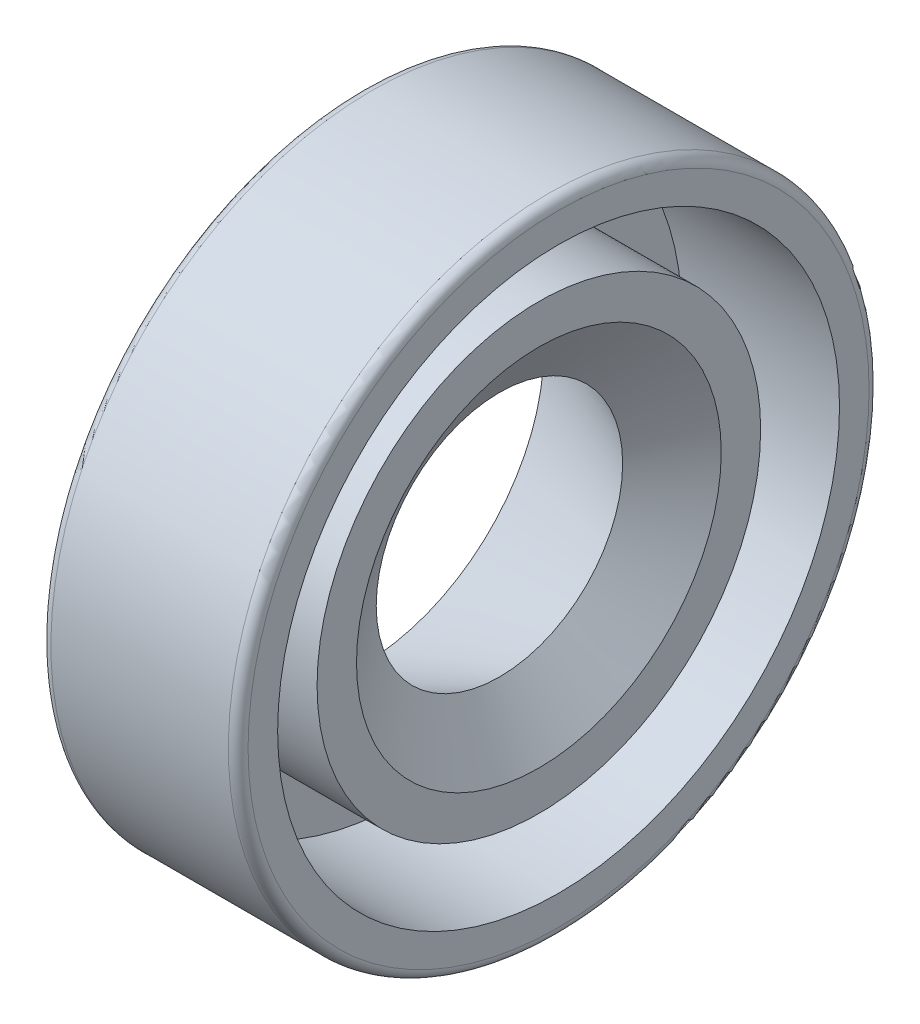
ISO-10303-21;
HEADER;
FILE_DESCRIPTION(('STEP AP214'),'2;1');
FILE_NAME('part.step','',(''),(''),'','','');
FILE_SCHEMA(('AUTOMOTIVE_DESIGN { 1 0 10303 214 1 1 1 1 }'));
ENDSEC;
DATA;
#1=APPLICATION_CONTEXT('core data for automotive mechanical design processes');
#2=APPLICATION_PROTOCOL_DEFINITION('international standard','automotive_design',2000,#1);
#3=PRODUCT_CONTEXT('',#1,'mechanical');
#4=PRODUCT('Part','Part','',(#3));
#5=PRODUCT_RELATED_PRODUCT_CATEGORY('part','',(#4));
#6=PRODUCT_DEFINITION_FORMATION('','',#4);
#7=PRODUCT_DEFINITION_CONTEXT('part definition',#1,'design');
#8=PRODUCT_DEFINITION('design','',#6,#7);
#9=PRODUCT_DEFINITION_SHAPE('','',#8);
#10=(LENGTH_UNIT() NAMED_UNIT(*) SI_UNIT(.MILLI.,.METRE.));
#11=(NAMED_UNIT(*) PLANE_ANGLE_UNIT() SI_UNIT($,.RADIAN.));
#12=(NAMED_UNIT(*) SI_UNIT($,.STERADIAN.) SOLID_ANGLE_UNIT());
#13=UNCERTAINTY_MEASURE_WITH_UNIT(LENGTH_MEASURE(1.E-05),#10,'distance_accuracy_value','');
#14=(GEOMETRIC_REPRESENTATION_CONTEXT(3) GLOBAL_UNCERTAINTY_ASSIGNED_CONTEXT((#13)) GLOBAL_UNIT_ASSIGNED_CONTEXT((#10,
#11,#12)) REPRESENTATION_CONTEXT('',''));
#15=CARTESIAN_POINT('',(0.,0.,0.));
#16=DIRECTION('',(0.,0.,1.));
#17=DIRECTION('',(1.,0.,0.));
#18=AXIS2_PLACEMENT_3D('',#15,#16,#17);
#19=CARTESIAN_POINT('',(-31.8,32.47,-32.));
#20=DIRECTION('',(-1.,0.,0.));
#21=DIRECTION('',(0.,0.,1.));
#22=AXIS2_PLACEMENT_3D('',#19,#20,#21);
#23=PLANE('',#22);
#24=CARTESIAN_POINT('',(-31.8000000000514,25.07,-32.));
#25=DIRECTION('',(1.,0.,0.));
#26=DIRECTION('',(0.,0.,-1.));
#27=AXIS2_PLACEMENT_3D('',#24,#25,#26);
#28=CIRCLE('',#27,7.39999999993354);
#29=CARTESIAN_POINT('',(-31.8000000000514,25.07,-39.3999999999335));
#30=VERTEX_POINT('',#29);
#31=EDGE_CURVE('E142',#30,#30,#28,.F.);
#32=ORIENTED_EDGE('',*,*,#31,.T.);
#33=EDGE_LOOP('',(#32));
#34=FACE_BOUND('',#33,.T.);
#35=CARTESIAN_POINT('',(-31.8,25.07,-32.));
#36=DIRECTION('',(1.,0.,0.));
#37=DIRECTION('',(0.,0.,-1.));
#38=AXIS2_PLACEMENT_3D('',#35,#36,#37);
#39=CIRCLE('',#38,9.);
#40=CARTESIAN_POINT('',(-31.8,25.07,-41.));
#41=VERTEX_POINT('',#40);
#42=EDGE_CURVE('E19',#41,#41,#39,.F.);
#43=ORIENTED_EDGE('',*,*,#42,.F.);
#44=EDGE_LOOP('',(#43));
#45=FACE_BOUND('',#44,.T.);
#46=ADVANCED_FACE('F15',(#34,#45),#23,.F.);
#47=CARTESIAN_POINT('',(-39.,25.07,-32.));
#48=DIRECTION('',(1.,0.,0.));
#49=DIRECTION('',(0.,0.,-1.));
#50=AXIS2_PLACEMENT_3D('',#47,#48,#49);
#51=CYLINDRICAL_SURFACE('',#50,9.);
#52=ORIENTED_EDGE('',*,*,#42,.T.);
#53=EDGE_LOOP('',(#52));
#54=FACE_BOUND('',#53,.T.);
#55=CARTESIAN_POINT('',(-37.4,25.07,-32.));
#56=DIRECTION('',(1.,0.,0.));
#57=DIRECTION('',(0.,0.,-1.));
#58=AXIS2_PLACEMENT_3D('',#55,#56,#57);
#59=CIRCLE('',#58,9.);
#60=CARTESIAN_POINT('',(-37.4,25.07,-41.));
#61=VERTEX_POINT('',#60);
#62=EDGE_CURVE('E140',#61,#61,#59,.T.);
#63=ORIENTED_EDGE('',*,*,#62,.T.);
#64=EDGE_LOOP('',(#63));
#65=FACE_BOUND('',#64,.T.);
#66=ADVANCED_FACE('F106',(#54,#65),#51,.T.);
#67=CARTESIAN_POINT('',(-31.8000000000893,25.07,-32.));
#68=DIRECTION('',(1.,0.,0.));
#69=DIRECTION('',(0.,0.,-1.));
#70=AXIS2_PLACEMENT_3D('',#67,#68,#69);
#71=CONICAL_SURFACE('',#70,7.39999999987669,0.982793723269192);
#72=CARTESIAN_POINT('',(-33.4,25.07,-32.));
#73=DIRECTION('',(-1.,0.,0.));
#74=DIRECTION('',(0.,1.,0.));
#75=AXIS2_PLACEMENT_3D('',#72,#73,#74);
#76=CIRCLE('',#75,5.);
#77=CARTESIAN_POINT('',(-33.4,30.07,-32.));
#78=VERTEX_POINT('',#77);
#79=EDGE_CURVE('E139',#78,#78,#76,.T.);
#80=ORIENTED_EDGE('',*,*,#79,.T.);
#81=EDGE_LOOP('',(#80));
#82=FACE_BOUND('',#81,.T.);
#83=ORIENTED_EDGE('',*,*,#31,.F.);
#84=EDGE_LOOP('',(#83));
#85=FACE_BOUND('',#84,.T.);
#86=ADVANCED_FACE('F102',(#82,#85),#71,.F.);
#87=CARTESIAN_POINT('',(-37.4,34.07,-32.));
#88=DIRECTION('',(-1.,0.,0.));
#89=DIRECTION('',(0.,0.,1.));
#90=AXIS2_PLACEMENT_3D('',#87,#88,#89);
#91=PLANE('',#90);
#92=ORIENTED_EDGE('',*,*,#62,.F.);
#93=EDGE_LOOP('',(#92));
#94=FACE_BOUND('',#93,.T.);
#95=CARTESIAN_POINT('',(-37.4,25.07,-32.));
#96=DIRECTION('',(1.,0.,0.));
#97=DIRECTION('',(0.,0.,-1.));
#98=AXIS2_PLACEMENT_3D('',#95,#96,#97);
#99=CIRCLE('',#98,11.4);
#100=CARTESIAN_POINT('',(-37.4,25.07,-43.4));
#101=VERTEX_POINT('',#100);
#102=EDGE_CURVE('E132',#101,#101,#99,.T.);
#103=ORIENTED_EDGE('',*,*,#102,.T.);
#104=EDGE_LOOP('',(#103));
#105=FACE_BOUND('',#104,.T.);
#106=ADVANCED_FACE('F98',(#94,#105),#91,.F.);
#107=CARTESIAN_POINT('',(-39.,25.07,-32.));
#108=DIRECTION('',(-1.,0.,0.));
#109=DIRECTION('',(0.,0.,1.));
#110=AXIS2_PLACEMENT_3D('',#107,#108,#109);
#111=CONICAL_SURFACE('',#110,7.4,0.404891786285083);
#112=CARTESIAN_POINT('',(-39.,25.07,-32.));
#113=DIRECTION('',(-1.,0.,0.));
#114=DIRECTION('',(0.,0.,1.));
#115=AXIS2_PLACEMENT_3D('',#112,#113,#114);
#116=CIRCLE('',#115,7.4);
#117=CARTESIAN_POINT('',(-39.,25.07,-24.6));
#118=VERTEX_POINT('',#117);
#119=EDGE_CURVE('E127',#118,#118,#116,.T.);
#120=ORIENTED_EDGE('',*,*,#119,.T.);
#121=EDGE_LOOP('',(#120));
#122=FACE_BOUND('',#121,.T.);
#123=ORIENTED_EDGE('',*,*,#79,.F.);
#124=EDGE_LOOP('',(#123));
#125=FACE_BOUND('',#124,.T.);
#126=ADVANCED_FACE('F94',(#122,#125),#111,.F.);
#127=CARTESIAN_POINT('',(-39.,25.07,-32.));
#128=DIRECTION('',(1.,0.,0.));
#129=DIRECTION('',(0.,0.,-1.));
#130=AXIS2_PLACEMENT_3D('',#127,#128,#129);
#131=CYLINDRICAL_SURFACE('',#130,11.4);
#132=ORIENTED_EDGE('',*,*,#102,.F.);
#133=EDGE_LOOP('',(#132));
#134=FACE_BOUND('',#133,.T.);
#135=CARTESIAN_POINT('',(-31.,25.07,-32.));
#136=DIRECTION('',(1.,0.,0.));
#137=DIRECTION('',(0.,0.,-1.));
#138=AXIS2_PLACEMENT_3D('',#135,#136,#137);
#139=CIRCLE('',#138,11.4);
#140=CARTESIAN_POINT('',(-31.,25.07,-43.4));
#141=VERTEX_POINT('',#140);
#142=EDGE_CURVE('E125',#141,#141,#139,.T.);
#143=ORIENTED_EDGE('',*,*,#142,.T.);
#144=EDGE_LOOP('',(#143));
#145=FACE_BOUND('',#144,.T.);
#146=ADVANCED_FACE('F90',(#134,#145),#131,.F.);
#147=CARTESIAN_POINT('',(-39.,37.67,-32.));
#148=DIRECTION('',(1.,0.,0.));
#149=DIRECTION('',(0.,0.,-1.));
#150=AXIS2_PLACEMENT_3D('',#147,#148,#149);
#151=PLANE('',#150);
#152=CARTESIAN_POINT('',(-39.,25.07,-32.));
#153=DIRECTION('',(1.,0.,0.));
#154=DIRECTION('',(0.,1.,0.));
#155=AXIS2_PLACEMENT_3D('',#152,#153,#154);
#156=CIRCLE('',#155,12.6);
#157=CARTESIAN_POINT('',(-39.,37.67,-32.));
#158=VERTEX_POINT('',#157);
#159=EDGE_CURVE('E124',#158,#158,#156,.T.);
#160=ORIENTED_EDGE('',*,*,#159,.F.);
#161=EDGE_LOOP('',(#160));
#162=FACE_BOUND('',#161,.T.);
#163=ORIENTED_EDGE('',*,*,#119,.F.);
#164=EDGE_LOOP('',(#163));
#165=FACE_BOUND('',#164,.T.);
#166=ADVANCED_FACE('F81',(#162,#165),#151,.F.);
#167=CARTESIAN_POINT('',(-31.,36.47,-32.));
#168=DIRECTION('',(-1.,0.,0.));
#169=DIRECTION('',(0.,0.,1.));
#170=AXIS2_PLACEMENT_3D('',#167,#168,#169);
#171=PLANE('',#170);
#172=ORIENTED_EDGE('',*,*,#142,.F.);
#173=EDGE_LOOP('',(#172));
#174=FACE_BOUND('',#173,.T.);
#175=CARTESIAN_POINT('',(-31.,25.07,-32.));
#176=DIRECTION('',(-1.,0.,0.));
#177=DIRECTION('',(0.,1.,0.));
#178=AXIS2_PLACEMENT_3D('',#175,#176,#177);
#179=CIRCLE('',#178,12.6);
#180=CARTESIAN_POINT('',(-31.,37.67,-32.));
#181=VERTEX_POINT('',#180);
#182=EDGE_CURVE('E28',#181,#181,#179,.T.);
#183=ORIENTED_EDGE('',*,*,#182,.F.);
#184=EDGE_LOOP('',(#183));
#185=FACE_BOUND('',#184,.T.);
#186=ADVANCED_FACE('F60',(#174,#185),#171,.F.);
#187=CARTESIAN_POINT('',(-38.6,25.07,-32.));
#188=DIRECTION('',(-1.,0.,0.));
#189=DIRECTION('',(0.,1.,0.));
#190=AXIS2_PLACEMENT_3D('',#187,#188,#189);
#191=TOROIDAL_SURFACE('',#190,12.6,0.4);
#192=CARTESIAN_POINT('',(-38.6,25.07,-32.));
#193=DIRECTION('',(1.,0.,0.));
#194=DIRECTION('',(0.,0.,-1.));
#195=AXIS2_PLACEMENT_3D('',#192,#193,#194);
#196=CIRCLE('',#195,13.);
#197=CARTESIAN_POINT('',(-38.6,25.07,-45.));
#198=VERTEX_POINT('',#197);
#199=EDGE_CURVE('E23',#198,#198,#196,.T.);
#200=ORIENTED_EDGE('',*,*,#199,.F.);
#201=EDGE_LOOP('',(#200));
#202=FACE_BOUND('',#201,.T.);
#203=ORIENTED_EDGE('',*,*,#159,.T.);
#204=EDGE_LOOP('',(#203));
#205=FACE_BOUND('',#204,.T.);
#206=ADVANCED_FACE('F56',(#202,#205),#191,.T.);
#207=CARTESIAN_POINT('',(-31.4,25.07,-32.));
#208=DIRECTION('',(-1.,0.,0.));
#209=DIRECTION('',(0.,1.,0.));
#210=AXIS2_PLACEMENT_3D('',#207,#208,#209);
#211=TOROIDAL_SURFACE('',#210,12.6,0.4);
#212=ORIENTED_EDGE('',*,*,#182,.T.);
#213=EDGE_LOOP('',(#212));
#214=FACE_BOUND('',#213,.T.);
#215=CARTESIAN_POINT('',(-31.4,25.07,-32.));
#216=DIRECTION('',(1.,0.,0.));
#217=DIRECTION('',(0.,0.,-1.));
#218=AXIS2_PLACEMENT_3D('',#215,#216,#217);
#219=CIRCLE('',#218,13.);
#220=CARTESIAN_POINT('',(-31.4,25.07,-45.));
#221=VERTEX_POINT('',#220);
#222=EDGE_CURVE('E10',#221,#221,#219,.F.);
#223=ORIENTED_EDGE('',*,*,#222,.F.);
#224=EDGE_LOOP('',(#223));
#225=FACE_BOUND('',#224,.T.);
#226=ADVANCED_FACE('F47',(#214,#225),#211,.T.);
#227=CARTESIAN_POINT('',(-39.,25.07,-32.));
#228=DIRECTION('',(1.,0.,0.));
#229=DIRECTION('',(0.,0.,-1.));
#230=AXIS2_PLACEMENT_3D('',#227,#228,#229);
#231=CYLINDRICAL_SURFACE('',#230,13.);
#232=ORIENTED_EDGE('',*,*,#222,.T.);
#233=EDGE_LOOP('',(#232));
#234=FACE_BOUND('',#233,.T.);
#235=ORIENTED_EDGE('',*,*,#199,.T.);
#236=EDGE_LOOP('',(#235));
#237=FACE_BOUND('',#236,.T.);
#238=ADVANCED_FACE('F17',(#234,#237),#231,.T.);
#239=CLOSED_SHELL('',(#46,#66,#86,#106,#126,#146,#166,#186,#206,#226,#238));
#240=MANIFOLD_SOLID_BREP('B1',#239);
#241=ADVANCED_BREP_SHAPE_REPRESENTATION('',(#18,#240),#14);
#242=SHAPE_DEFINITION_REPRESENTATION(#9,#241);
ENDSEC;
END-ISO-10303-21;
